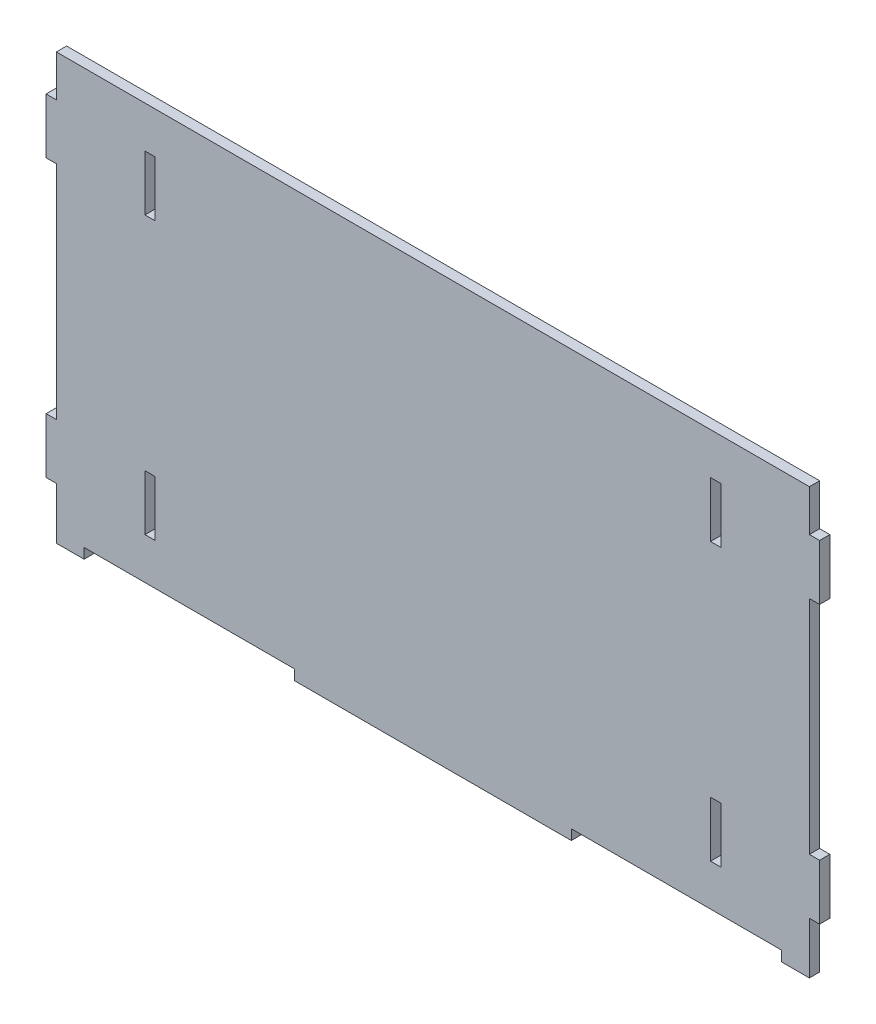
ISO-10303-21;
HEADER;
FILE_DESCRIPTION(('STEP AP214'),'2;1');
FILE_NAME('part.step','',(''),(''),'','','');
FILE_SCHEMA(('AUTOMOTIVE_DESIGN { 1 0 10303 214 1 1 1 1 }'));
ENDSEC;
DATA;
#1=APPLICATION_CONTEXT('core data for automotive mechanical design processes');
#2=APPLICATION_PROTOCOL_DEFINITION('international standard','automotive_design',2000,#1);
#3=PRODUCT_CONTEXT('',#1,'mechanical');
#4=PRODUCT('Part','Part','',(#3));
#5=PRODUCT_RELATED_PRODUCT_CATEGORY('part','',(#4));
#6=PRODUCT_DEFINITION_FORMATION('','',#4);
#7=PRODUCT_DEFINITION_CONTEXT('part definition',#1,'design');
#8=PRODUCT_DEFINITION('design','',#6,#7);
#9=PRODUCT_DEFINITION_SHAPE('','',#8);
#10=(LENGTH_UNIT() NAMED_UNIT(*) SI_UNIT(.MILLI.,.METRE.));
#11=(NAMED_UNIT(*) PLANE_ANGLE_UNIT() SI_UNIT($,.RADIAN.));
#12=(NAMED_UNIT(*) SI_UNIT($,.STERADIAN.) SOLID_ANGLE_UNIT());
#13=UNCERTAINTY_MEASURE_WITH_UNIT(LENGTH_MEASURE(1.E-05),#10,'distance_accuracy_value','');
#14=(GEOMETRIC_REPRESENTATION_CONTEXT(3) GLOBAL_UNCERTAINTY_ASSIGNED_CONTEXT((#13)) GLOBAL_UNIT_ASSIGNED_CONTEXT((#10,
#11,#12)) REPRESENTATION_CONTEXT('',''));
#15=CARTESIAN_POINT('',(0.,0.,0.));
#16=DIRECTION('',(0.,0.,1.));
#17=DIRECTION('',(1.,0.,0.));
#18=AXIS2_PLACEMENT_3D('',#15,#16,#17);
#19=CARTESIAN_POINT('',(-136.,138.7,3.7));
#20=DIRECTION('',(0.,0.,-1.));
#21=DIRECTION('',(-1.,0.,0.));
#22=AXIS2_PLACEMENT_3D('',#19,#20,#21);
#23=PLANE('',#22);
#24=DIRECTION('',(0.,-1.,0.));
#25=VECTOR('',#24,1.);
#26=CARTESIAN_POINT('',(100.3,138.7,3.7));
#27=LINE('',#26,#25);
#28=CARTESIAN_POINT('',(100.3,138.7,3.7));
#29=VERTEX_POINT('',#28);
#30=CARTESIAN_POINT('',(100.3,118.7,3.7));
#31=VERTEX_POINT('',#30);
#32=EDGE_CURVE('E350',#29,#31,#27,.T.);
#33=ORIENTED_EDGE('',*,*,#32,.F.);
#34=DIRECTION('',(-1.,0.,0.));
#35=VECTOR('',#34,1.);
#36=CARTESIAN_POINT('',(100.3,138.7,3.7));
#37=LINE('',#36,#35);
#38=CARTESIAN_POINT('',(104.,138.7,3.7));
#39=VERTEX_POINT('',#38);
#40=EDGE_CURVE('E358',#39,#29,#37,.T.);
#41=ORIENTED_EDGE('',*,*,#40,.F.);
#42=DIRECTION('',(0.,1.,0.));
#43=VECTOR('',#42,1.);
#44=CARTESIAN_POINT('',(104.,138.7,3.7));
#45=LINE('',#44,#43);
#46=CARTESIAN_POINT('',(104.,118.7,3.7));
#47=VERTEX_POINT('',#46);
#48=EDGE_CURVE('E355',#47,#39,#45,.T.);
#49=ORIENTED_EDGE('',*,*,#48,.F.);
#50=DIRECTION('',(1.,0.,0.));
#51=VECTOR('',#50,1.);
#52=CARTESIAN_POINT('',(100.3,118.7,3.7));
#53=LINE('',#52,#51);
#54=EDGE_CURVE('E352',#31,#47,#53,.T.);
#55=ORIENTED_EDGE('',*,*,#54,.F.);
#56=EDGE_LOOP('',(#33,#41,#49,#55));
#57=FACE_BOUND('',#56,.T.);
#58=DIRECTION('',(0.,-1.,0.));
#59=VECTOR('',#58,1.);
#60=CARTESIAN_POINT('',(-104.,138.7,3.7));
#61=LINE('',#60,#59);
#62=CARTESIAN_POINT('',(-104.,138.7,3.7));
#63=VERTEX_POINT('',#62);
#64=CARTESIAN_POINT('',(-104.,118.7,3.7));
#65=VERTEX_POINT('',#64);
#66=EDGE_CURVE('E412',#63,#65,#61,.T.);
#67=ORIENTED_EDGE('',*,*,#66,.F.);
#68=DIRECTION('',(-1.,0.,0.));
#69=VECTOR('',#68,1.);
#70=CARTESIAN_POINT('',(-104.,138.7,3.7));
#71=LINE('',#70,#69);
#72=CARTESIAN_POINT('',(-100.3,138.7,3.7));
#73=VERTEX_POINT('',#72);
#74=EDGE_CURVE('E420',#73,#63,#71,.T.);
#75=ORIENTED_EDGE('',*,*,#74,.F.);
#76=DIRECTION('',(0.,1.,0.));
#77=VECTOR('',#76,1.);
#78=CARTESIAN_POINT('',(-100.3,138.7,3.7));
#79=LINE('',#78,#77);
#80=CARTESIAN_POINT('',(-100.3,118.7,3.7));
#81=VERTEX_POINT('',#80);
#82=EDGE_CURVE('E417',#81,#73,#79,.T.);
#83=ORIENTED_EDGE('',*,*,#82,.F.);
#84=DIRECTION('',(1.,0.,0.));
#85=VECTOR('',#84,1.);
#86=CARTESIAN_POINT('',(-104.,118.7,3.7));
#87=LINE('',#86,#85);
#88=EDGE_CURVE('E414',#65,#81,#87,.T.);
#89=ORIENTED_EDGE('',*,*,#88,.F.);
#90=EDGE_LOOP('',(#67,#75,#83,#89));
#91=FACE_BOUND('',#90,.T.);
#92=DIRECTION('',(0.,-1.,0.));
#93=VECTOR('',#92,1.);
#94=CARTESIAN_POINT('',(-136.,153.7,3.7));
#95=LINE('',#94,#93);
#96=CARTESIAN_POINT('',(-136.,153.7,3.7));
#97=VERTEX_POINT('',#96);
#98=CARTESIAN_POINT('',(-136.,138.7,3.7));
#99=VERTEX_POINT('',#98);
#100=EDGE_CURVE('E443',#97,#99,#95,.T.);
#101=ORIENTED_EDGE('',*,*,#100,.T.);
#102=DIRECTION('',(-1.,0.,0.));
#103=VECTOR('',#102,1.);
#104=CARTESIAN_POINT('',(-136.,138.7,3.7));
#105=LINE('',#104,#103);
#106=CARTESIAN_POINT('',(-139.7,138.7,3.7));
#107=VERTEX_POINT('',#106);
#108=EDGE_CURVE('E446',#99,#107,#105,.T.);
#109=ORIENTED_EDGE('',*,*,#108,.T.);
#110=DIRECTION('',(0.,-1.,0.));
#111=VECTOR('',#110,1.);
#112=CARTESIAN_POINT('',(-139.7,138.7,3.7));
#113=LINE('',#112,#111);
#114=CARTESIAN_POINT('',(-139.7,118.7,3.7));
#115=VERTEX_POINT('',#114);
#116=EDGE_CURVE('E449',#107,#115,#113,.T.);
#117=ORIENTED_EDGE('',*,*,#116,.T.);
#118=DIRECTION('',(1.,0.,0.));
#119=VECTOR('',#118,1.);
#120=CARTESIAN_POINT('',(-136.,118.7,3.7));
#121=LINE('',#120,#119);
#122=CARTESIAN_POINT('',(-136.,118.7,3.7));
#123=VERTEX_POINT('',#122);
#124=EDGE_CURVE('E451',#115,#123,#121,.T.);
#125=ORIENTED_EDGE('',*,*,#124,.T.);
#126=DIRECTION('',(0.,-1.,0.));
#127=VECTOR('',#126,1.);
#128=CARTESIAN_POINT('',(-136.,118.7,3.7));
#129=LINE('',#128,#127);
#130=CARTESIAN_POINT('',(-136.,38.7,3.7));
#131=VERTEX_POINT('',#130);
#132=EDGE_CURVE('E453',#123,#131,#129,.T.);
#133=ORIENTED_EDGE('',*,*,#132,.T.);
#134=DIRECTION('',(-1.,0.,0.));
#135=VECTOR('',#134,1.);
#136=CARTESIAN_POINT('',(-136.,38.7,3.7));
#137=LINE('',#136,#135);
#138=CARTESIAN_POINT('',(-139.7,38.7,3.7));
#139=VERTEX_POINT('',#138);
#140=EDGE_CURVE('E455',#131,#139,#137,.T.);
#141=ORIENTED_EDGE('',*,*,#140,.T.);
#142=DIRECTION('',(0.,-1.,0.));
#143=VECTOR('',#142,1.);
#144=CARTESIAN_POINT('',(-139.7,38.7,3.7));
#145=LINE('',#144,#143);
#146=CARTESIAN_POINT('',(-139.7,18.7,3.7));
#147=VERTEX_POINT('',#146);
#148=EDGE_CURVE('E457',#139,#147,#145,.T.);
#149=ORIENTED_EDGE('',*,*,#148,.T.);
#150=DIRECTION('',(1.,0.,0.));
#151=VECTOR('',#150,1.);
#152=CARTESIAN_POINT('',(-136.,18.7,3.7));
#153=LINE('',#152,#151);
#154=CARTESIAN_POINT('',(-136.,18.7,3.7));
#155=VERTEX_POINT('',#154);
#156=EDGE_CURVE('E459',#147,#155,#153,.T.);
#157=ORIENTED_EDGE('',*,*,#156,.T.);
#158=DIRECTION('',(0.,-1.,0.));
#159=VECTOR('',#158,1.);
#160=CARTESIAN_POINT('',(-136.,18.7,3.7));
#161=LINE('',#160,#159);
#162=CARTESIAN_POINT('',(-136.,0.,3.7));
#163=VERTEX_POINT('',#162);
#164=EDGE_CURVE('E461',#155,#163,#161,.T.);
#165=ORIENTED_EDGE('',*,*,#164,.T.);
#166=DIRECTION('',(1.,0.,0.));
#167=VECTOR('',#166,1.);
#168=CARTESIAN_POINT('',(-136.,0.,3.7));
#169=LINE('',#168,#167);
#170=CARTESIAN_POINT('',(-126.,0.,3.7));
#171=VERTEX_POINT('',#170);
#172=EDGE_CURVE('E463',#163,#171,#169,.T.);
#173=ORIENTED_EDGE('',*,*,#172,.T.);
#174=DIRECTION('',(0.,1.,0.));
#175=VECTOR('',#174,1.);
#176=CARTESIAN_POINT('',(-126.,0.,3.7));
#177=LINE('',#176,#175);
#178=CARTESIAN_POINT('',(-126.,3.7,3.7));
#179=VERTEX_POINT('',#178);
#180=EDGE_CURVE('E465',#171,#179,#177,.T.);
#181=ORIENTED_EDGE('',*,*,#180,.T.);
#182=DIRECTION('',(1.,0.,0.));
#183=VECTOR('',#182,1.);
#184=CARTESIAN_POINT('',(-126.,3.7,3.7));
#185=LINE('',#184,#183);
#186=CARTESIAN_POINT('',(-50.,3.7,3.7));
#187=VERTEX_POINT('',#186);
#188=EDGE_CURVE('E467',#179,#187,#185,.T.);
#189=ORIENTED_EDGE('',*,*,#188,.T.);
#190=DIRECTION('',(0.,-1.,0.));
#191=VECTOR('',#190,1.);
#192=CARTESIAN_POINT('',(-50.,0.,3.7));
#193=LINE('',#192,#191);
#194=CARTESIAN_POINT('',(-50.,0.,3.7));
#195=VERTEX_POINT('',#194);
#196=EDGE_CURVE('E469',#187,#195,#193,.T.);
#197=ORIENTED_EDGE('',*,*,#196,.T.);
#198=DIRECTION('',(1.,0.,0.));
#199=VECTOR('',#198,1.);
#200=CARTESIAN_POINT('',(-50.,0.,3.7));
#201=LINE('',#200,#199);
#202=CARTESIAN_POINT('',(50.,0.,3.7));
#203=VERTEX_POINT('',#202);
#204=EDGE_CURVE('E471',#195,#203,#201,.T.);
#205=ORIENTED_EDGE('',*,*,#204,.T.);
#206=DIRECTION('',(0.,1.,0.));
#207=VECTOR('',#206,1.);
#208=CARTESIAN_POINT('',(50.,0.,3.7));
#209=LINE('',#208,#207);
#210=CARTESIAN_POINT('',(50.,3.7,3.7));
#211=VERTEX_POINT('',#210);
#212=EDGE_CURVE('E473',#203,#211,#209,.T.);
#213=ORIENTED_EDGE('',*,*,#212,.T.);
#214=DIRECTION('',(1.,0.,0.));
#215=VECTOR('',#214,1.);
#216=CARTESIAN_POINT('',(50.,3.7,3.7));
#217=LINE('',#216,#215);
#218=CARTESIAN_POINT('',(126.,3.7,3.7));
#219=VERTEX_POINT('',#218);
#220=EDGE_CURVE('E475',#211,#219,#217,.T.);
#221=ORIENTED_EDGE('',*,*,#220,.T.);
#222=DIRECTION('',(0.,-1.,0.));
#223=VECTOR('',#222,1.);
#224=CARTESIAN_POINT('',(126.,0.,3.7));
#225=LINE('',#224,#223);
#226=CARTESIAN_POINT('',(126.,0.,3.7));
#227=VERTEX_POINT('',#226);
#228=EDGE_CURVE('E477',#219,#227,#225,.T.);
#229=ORIENTED_EDGE('',*,*,#228,.T.);
#230=DIRECTION('',(1.,0.,0.));
#231=VECTOR('',#230,1.);
#232=CARTESIAN_POINT('',(126.,0.,3.7));
#233=LINE('',#232,#231);
#234=CARTESIAN_POINT('',(136.,0.,3.7));
#235=VERTEX_POINT('',#234);
#236=EDGE_CURVE('E479',#227,#235,#233,.T.);
#237=ORIENTED_EDGE('',*,*,#236,.T.);
#238=DIRECTION('',(0.,1.,0.));
#239=VECTOR('',#238,1.);
#240=CARTESIAN_POINT('',(136.,18.7,3.7));
#241=LINE('',#240,#239);
#242=CARTESIAN_POINT('',(136.,18.7,3.7));
#243=VERTEX_POINT('',#242);
#244=EDGE_CURVE('E481',#235,#243,#241,.T.);
#245=ORIENTED_EDGE('',*,*,#244,.T.);
#246=DIRECTION('',(1.,0.,0.));
#247=VECTOR('',#246,1.);
#248=CARTESIAN_POINT('',(136.,18.7,3.7));
#249=LINE('',#248,#247);
#250=CARTESIAN_POINT('',(139.7,18.7,3.7));
#251=VERTEX_POINT('',#250);
#252=EDGE_CURVE('E483',#243,#251,#249,.T.);
#253=ORIENTED_EDGE('',*,*,#252,.T.);
#254=DIRECTION('',(0.,1.,0.));
#255=VECTOR('',#254,1.);
#256=CARTESIAN_POINT('',(139.7,38.7,3.7));
#257=LINE('',#256,#255);
#258=CARTESIAN_POINT('',(139.7,38.7,3.7));
#259=VERTEX_POINT('',#258);
#260=EDGE_CURVE('E485',#251,#259,#257,.T.);
#261=ORIENTED_EDGE('',*,*,#260,.T.);
#262=DIRECTION('',(-1.,0.,0.));
#263=VECTOR('',#262,1.);
#264=CARTESIAN_POINT('',(136.,38.7,3.7));
#265=LINE('',#264,#263);
#266=CARTESIAN_POINT('',(136.,38.7,3.7));
#267=VERTEX_POINT('',#266);
#268=EDGE_CURVE('E487',#259,#267,#265,.T.);
#269=ORIENTED_EDGE('',*,*,#268,.T.);
#270=DIRECTION('',(0.,1.,0.));
#271=VECTOR('',#270,1.);
#272=CARTESIAN_POINT('',(136.,118.7,3.7));
#273=LINE('',#272,#271);
#274=CARTESIAN_POINT('',(136.,118.7,3.7));
#275=VERTEX_POINT('',#274);
#276=EDGE_CURVE('E489',#267,#275,#273,.T.);
#277=ORIENTED_EDGE('',*,*,#276,.T.);
#278=DIRECTION('',(1.,0.,0.));
#279=VECTOR('',#278,1.);
#280=CARTESIAN_POINT('',(136.,118.7,3.7));
#281=LINE('',#280,#279);
#282=CARTESIAN_POINT('',(139.7,118.7,3.7));
#283=VERTEX_POINT('',#282);
#284=EDGE_CURVE('E491',#275,#283,#281,.T.);
#285=ORIENTED_EDGE('',*,*,#284,.T.);
#286=DIRECTION('',(0.,1.,0.));
#287=VECTOR('',#286,1.);
#288=CARTESIAN_POINT('',(139.7,138.7,3.7));
#289=LINE('',#288,#287);
#290=CARTESIAN_POINT('',(139.7,138.7,3.7));
#291=VERTEX_POINT('',#290);
#292=EDGE_CURVE('E493',#283,#291,#289,.T.);
#293=ORIENTED_EDGE('',*,*,#292,.T.);
#294=DIRECTION('',(-1.,0.,0.));
#295=VECTOR('',#294,1.);
#296=CARTESIAN_POINT('',(136.,138.7,3.7));
#297=LINE('',#296,#295);
#298=CARTESIAN_POINT('',(136.,138.7,3.7));
#299=VERTEX_POINT('',#298);
#300=EDGE_CURVE('E495',#291,#299,#297,.T.);
#301=ORIENTED_EDGE('',*,*,#300,.T.);
#302=DIRECTION('',(0.,1.,0.));
#303=VECTOR('',#302,1.);
#304=CARTESIAN_POINT('',(136.,153.7,3.7));
#305=LINE('',#304,#303);
#306=CARTESIAN_POINT('',(136.,153.7,3.7));
#307=VERTEX_POINT('',#306);
#308=EDGE_CURVE('E497',#299,#307,#305,.T.);
#309=ORIENTED_EDGE('',*,*,#308,.T.);
#310=DIRECTION('',(-1.,0.,0.));
#311=VECTOR('',#310,1.);
#312=CARTESIAN_POINT('',(-136.,153.7,3.7));
#313=LINE('',#312,#311);
#314=EDGE_CURVE('E499',#307,#97,#313,.T.);
#315=ORIENTED_EDGE('',*,*,#314,.T.);
#316=EDGE_LOOP('',(#101,#109,#117,#125,#133,#141,#149,#157,#165,#173,#181,#189,#197,#205,#213,
#221,#229,#237,#245,#253,#261,#269,#277,#285,#293,#301,#309,#315));
#317=FACE_BOUND('',#316,.T.);
#318=DIRECTION('',(1.,0.,0.));
#319=VECTOR('',#318,1.);
#320=CARTESIAN_POINT('',(-104.,18.7,3.7));
#321=LINE('',#320,#319);
#322=CARTESIAN_POINT('',(-104.,18.7,3.7));
#323=VERTEX_POINT('',#322);
#324=CARTESIAN_POINT('',(-100.3,18.7,3.7));
#325=VERTEX_POINT('',#324);
#326=EDGE_CURVE('E381',#323,#325,#321,.T.);
#327=ORIENTED_EDGE('',*,*,#326,.F.);
#328=DIRECTION('',(0.,-1.,0.));
#329=VECTOR('',#328,1.);
#330=CARTESIAN_POINT('',(-104.,38.7,3.7));
#331=LINE('',#330,#329);
#332=CARTESIAN_POINT('',(-104.,38.7,3.7));
#333=VERTEX_POINT('',#332);
#334=EDGE_CURVE('E389',#333,#323,#331,.T.);
#335=ORIENTED_EDGE('',*,*,#334,.F.);
#336=DIRECTION('',(-1.,0.,0.));
#337=VECTOR('',#336,1.);
#338=CARTESIAN_POINT('',(-104.,38.7,3.7));
#339=LINE('',#338,#337);
#340=CARTESIAN_POINT('',(-100.3,38.7,3.7));
#341=VERTEX_POINT('',#340);
#342=EDGE_CURVE('E386',#341,#333,#339,.T.);
#343=ORIENTED_EDGE('',*,*,#342,.F.);
#344=DIRECTION('',(0.,1.,0.));
#345=VECTOR('',#344,1.);
#346=CARTESIAN_POINT('',(-100.3,38.7,3.7));
#347=LINE('',#346,#345);
#348=EDGE_CURVE('E383',#325,#341,#347,.T.);
#349=ORIENTED_EDGE('',*,*,#348,.F.);
#350=EDGE_LOOP('',(#327,#335,#343,#349));
#351=FACE_BOUND('',#350,.T.);
#352=DIRECTION('',(0.,1.,0.));
#353=VECTOR('',#352,1.);
#354=CARTESIAN_POINT('',(104.,38.7,3.7));
#355=LINE('',#354,#353);
#356=CARTESIAN_POINT('',(104.,18.7,3.7));
#357=VERTEX_POINT('',#356);
#358=CARTESIAN_POINT('',(104.,38.7,3.7));
#359=VERTEX_POINT('',#358);
#360=EDGE_CURVE('E314',#357,#359,#355,.T.);
#361=ORIENTED_EDGE('',*,*,#360,.F.);
#362=DIRECTION('',(1.,0.,0.));
#363=VECTOR('',#362,1.);
#364=CARTESIAN_POINT('',(100.3,18.7,3.7));
#365=LINE('',#364,#363);
#366=CARTESIAN_POINT('',(100.3,18.7,3.7));
#367=VERTEX_POINT('',#366);
#368=EDGE_CURVE('E336',#367,#357,#365,.T.);
#369=ORIENTED_EDGE('',*,*,#368,.F.);
#370=DIRECTION('',(0.,-1.,0.));
#371=VECTOR('',#370,1.);
#372=CARTESIAN_POINT('',(100.3,38.7,3.7));
#373=LINE('',#372,#371);
#374=CARTESIAN_POINT('',(100.3,38.7,3.7));
#375=VERTEX_POINT('',#374);
#376=EDGE_CURVE('E334',#375,#367,#373,.T.);
#377=ORIENTED_EDGE('',*,*,#376,.F.);
#378=DIRECTION('',(-1.,0.,0.));
#379=VECTOR('',#378,1.);
#380=CARTESIAN_POINT('',(100.3,38.7,3.7));
#381=LINE('',#380,#379);
#382=EDGE_CURVE('E322',#359,#375,#381,.T.);
#383=ORIENTED_EDGE('',*,*,#382,.F.);
#384=EDGE_LOOP('',(#361,#369,#377,#383));
#385=FACE_BOUND('',#384,.T.);
#386=ADVANCED_FACE('F33',(#57,#91,#317,#351,#385),#23,.F.);
#387=CARTESIAN_POINT('',(-136.,138.7,0.));
#388=DIRECTION('',(0.,0.,-1.));
#389=DIRECTION('',(-1.,0.,0.));
#390=AXIS2_PLACEMENT_3D('',#387,#388,#389);
#391=PLANE('',#390);
#392=DIRECTION('',(-1.,0.,0.));
#393=VECTOR('',#392,1.);
#394=CARTESIAN_POINT('',(100.3,138.7,0.));
#395=LINE('',#394,#393);
#396=CARTESIAN_POINT('',(104.,138.7,0.));
#397=VERTEX_POINT('',#396);
#398=CARTESIAN_POINT('',(100.3,138.7,0.));
#399=VERTEX_POINT('',#398);
#400=EDGE_CURVE('E353',#397,#399,#395,.T.);
#401=ORIENTED_EDGE('',*,*,#400,.T.);
#402=DIRECTION('',(0.,-1.,0.));
#403=VECTOR('',#402,1.);
#404=CARTESIAN_POINT('',(100.3,138.7,0.));
#405=LINE('',#404,#403);
#406=CARTESIAN_POINT('',(100.3,118.7,0.));
#407=VERTEX_POINT('',#406);
#408=EDGE_CURVE('E330',#399,#407,#405,.T.);
#409=ORIENTED_EDGE('',*,*,#408,.T.);
#410=DIRECTION('',(1.,0.,0.));
#411=VECTOR('',#410,1.);
#412=CARTESIAN_POINT('',(100.3,118.7,0.));
#413=LINE('',#412,#411);
#414=CARTESIAN_POINT('',(104.,118.7,0.));
#415=VERTEX_POINT('',#414);
#416=EDGE_CURVE('E363',#407,#415,#413,.T.);
#417=ORIENTED_EDGE('',*,*,#416,.T.);
#418=DIRECTION('',(0.,1.,0.));
#419=VECTOR('',#418,1.);
#420=CARTESIAN_POINT('',(104.,138.7,0.));
#421=LINE('',#420,#419);
#422=EDGE_CURVE('E366',#415,#397,#421,.T.);
#423=ORIENTED_EDGE('',*,*,#422,.T.);
#424=EDGE_LOOP('',(#401,#409,#417,#423));
#425=FACE_BOUND('',#424,.T.);
#426=DIRECTION('',(-1.,0.,0.));
#427=VECTOR('',#426,1.);
#428=CARTESIAN_POINT('',(-104.,138.7,0.));
#429=LINE('',#428,#427);
#430=CARTESIAN_POINT('',(-100.3,138.7,0.));
#431=VERTEX_POINT('',#430);
#432=CARTESIAN_POINT('',(-104.,138.7,0.));
#433=VERTEX_POINT('',#432);
#434=EDGE_CURVE('E415',#431,#433,#429,.T.);
#435=ORIENTED_EDGE('',*,*,#434,.T.);
#436=DIRECTION('',(0.,-1.,0.));
#437=VECTOR('',#436,1.);
#438=CARTESIAN_POINT('',(-104.,138.7,0.));
#439=LINE('',#438,#437);
#440=CARTESIAN_POINT('',(-104.,118.7,0.));
#441=VERTEX_POINT('',#440);
#442=EDGE_CURVE('E411',#433,#441,#439,.T.);
#443=ORIENTED_EDGE('',*,*,#442,.T.);
#444=DIRECTION('',(1.,0.,0.));
#445=VECTOR('',#444,1.);
#446=CARTESIAN_POINT('',(-104.,118.7,0.));
#447=LINE('',#446,#445);
#448=CARTESIAN_POINT('',(-100.3,118.7,0.));
#449=VERTEX_POINT('',#448);
#450=EDGE_CURVE('E425',#441,#449,#447,.T.);
#451=ORIENTED_EDGE('',*,*,#450,.T.);
#452=DIRECTION('',(0.,1.,0.));
#453=VECTOR('',#452,1.);
#454=CARTESIAN_POINT('',(-100.3,138.7,0.));
#455=LINE('',#454,#453);
#456=EDGE_CURVE('E428',#449,#431,#455,.T.);
#457=ORIENTED_EDGE('',*,*,#456,.T.);
#458=EDGE_LOOP('',(#435,#443,#451,#457));
#459=FACE_BOUND('',#458,.T.);
#460=DIRECTION('',(0.,-1.,0.));
#461=VECTOR('',#460,1.);
#462=CARTESIAN_POINT('',(-136.,153.7,0.));
#463=LINE('',#462,#461);
#464=CARTESIAN_POINT('',(-136.,153.7,0.));
#465=VERTEX_POINT('',#464);
#466=CARTESIAN_POINT('',(-136.,138.7,0.));
#467=VERTEX_POINT('',#466);
#468=EDGE_CURVE('E442',#465,#467,#463,.T.);
#469=ORIENTED_EDGE('',*,*,#468,.F.);
#470=DIRECTION('',(-1.,0.,0.));
#471=VECTOR('',#470,1.);
#472=CARTESIAN_POINT('',(-136.,153.7,0.));
#473=LINE('',#472,#471);
#474=CARTESIAN_POINT('',(136.,153.7,0.));
#475=VERTEX_POINT('',#474);
#476=EDGE_CURVE('E447',#475,#465,#473,.T.);
#477=ORIENTED_EDGE('',*,*,#476,.F.);
#478=DIRECTION('',(0.,1.,0.));
#479=VECTOR('',#478,1.);
#480=CARTESIAN_POINT('',(136.,153.7,0.));
#481=LINE('',#480,#479);
#482=CARTESIAN_POINT('',(136.,138.7,0.));
#483=VERTEX_POINT('',#482);
#484=EDGE_CURVE('E554',#483,#475,#481,.T.);
#485=ORIENTED_EDGE('',*,*,#484,.F.);
#486=DIRECTION('',(-1.,0.,0.));
#487=VECTOR('',#486,1.);
#488=CARTESIAN_POINT('',(136.,138.7,0.));
#489=LINE('',#488,#487);
#490=CARTESIAN_POINT('',(139.7,138.7,0.));
#491=VERTEX_POINT('',#490);
#492=EDGE_CURVE('E552',#491,#483,#489,.T.);
#493=ORIENTED_EDGE('',*,*,#492,.F.);
#494=DIRECTION('',(0.,1.,0.));
#495=VECTOR('',#494,1.);
#496=CARTESIAN_POINT('',(139.7,138.7,0.));
#497=LINE('',#496,#495);
#498=CARTESIAN_POINT('',(139.7,118.7,0.));
#499=VERTEX_POINT('',#498);
#500=EDGE_CURVE('E550',#499,#491,#497,.T.);
#501=ORIENTED_EDGE('',*,*,#500,.F.);
#502=DIRECTION('',(1.,0.,0.));
#503=VECTOR('',#502,1.);
#504=CARTESIAN_POINT('',(136.,118.7,0.));
#505=LINE('',#504,#503);
#506=CARTESIAN_POINT('',(136.,118.7,0.));
#507=VERTEX_POINT('',#506);
#508=EDGE_CURVE('E548',#507,#499,#505,.T.);
#509=ORIENTED_EDGE('',*,*,#508,.F.);
#510=DIRECTION('',(0.,1.,0.));
#511=VECTOR('',#510,1.);
#512=CARTESIAN_POINT('',(136.,118.7,0.));
#513=LINE('',#512,#511);
#514=CARTESIAN_POINT('',(136.,38.7,0.));
#515=VERTEX_POINT('',#514);
#516=EDGE_CURVE('E546',#515,#507,#513,.T.);
#517=ORIENTED_EDGE('',*,*,#516,.F.);
#518=DIRECTION('',(-1.,0.,0.));
#519=VECTOR('',#518,1.);
#520=CARTESIAN_POINT('',(136.,38.7,0.));
#521=LINE('',#520,#519);
#522=CARTESIAN_POINT('',(139.7,38.7,0.));
#523=VERTEX_POINT('',#522);
#524=EDGE_CURVE('E544',#523,#515,#521,.T.);
#525=ORIENTED_EDGE('',*,*,#524,.F.);
#526=DIRECTION('',(0.,1.,0.));
#527=VECTOR('',#526,1.);
#528=CARTESIAN_POINT('',(139.7,38.7,0.));
#529=LINE('',#528,#527);
#530=CARTESIAN_POINT('',(139.7,18.7,0.));
#531=VERTEX_POINT('',#530);
#532=EDGE_CURVE('E542',#531,#523,#529,.T.);
#533=ORIENTED_EDGE('',*,*,#532,.F.);
#534=DIRECTION('',(1.,0.,0.));
#535=VECTOR('',#534,1.);
#536=CARTESIAN_POINT('',(136.,18.7,0.));
#537=LINE('',#536,#535);
#538=CARTESIAN_POINT('',(136.,18.7,0.));
#539=VERTEX_POINT('',#538);
#540=EDGE_CURVE('E540',#539,#531,#537,.T.);
#541=ORIENTED_EDGE('',*,*,#540,.F.);
#542=DIRECTION('',(0.,1.,0.));
#543=VECTOR('',#542,1.);
#544=CARTESIAN_POINT('',(136.,18.7,0.));
#545=LINE('',#544,#543);
#546=CARTESIAN_POINT('',(136.,0.,0.));
#547=VERTEX_POINT('',#546);
#548=EDGE_CURVE('E538',#547,#539,#545,.T.);
#549=ORIENTED_EDGE('',*,*,#548,.F.);
#550=DIRECTION('',(1.,0.,0.));
#551=VECTOR('',#550,1.);
#552=CARTESIAN_POINT('',(126.,0.,0.));
#553=LINE('',#552,#551);
#554=CARTESIAN_POINT('',(126.,0.,0.));
#555=VERTEX_POINT('',#554);
#556=EDGE_CURVE('E536',#555,#547,#553,.T.);
#557=ORIENTED_EDGE('',*,*,#556,.F.);
#558=DIRECTION('',(0.,-1.,0.));
#559=VECTOR('',#558,1.);
#560=CARTESIAN_POINT('',(126.,0.,0.));
#561=LINE('',#560,#559);
#562=CARTESIAN_POINT('',(126.,3.7,0.));
#563=VERTEX_POINT('',#562);
#564=EDGE_CURVE('E534',#563,#555,#561,.T.);
#565=ORIENTED_EDGE('',*,*,#564,.F.);
#566=DIRECTION('',(1.,0.,0.));
#567=VECTOR('',#566,1.);
#568=CARTESIAN_POINT('',(50.,3.7,0.));
#569=LINE('',#568,#567);
#570=CARTESIAN_POINT('',(50.,3.7,0.));
#571=VERTEX_POINT('',#570);
#572=EDGE_CURVE('E532',#571,#563,#569,.T.);
#573=ORIENTED_EDGE('',*,*,#572,.F.);
#574=DIRECTION('',(0.,1.,0.));
#575=VECTOR('',#574,1.);
#576=CARTESIAN_POINT('',(50.,0.,0.));
#577=LINE('',#576,#575);
#578=CARTESIAN_POINT('',(50.,0.,0.));
#579=VERTEX_POINT('',#578);
#580=EDGE_CURVE('E530',#579,#571,#577,.T.);
#581=ORIENTED_EDGE('',*,*,#580,.F.);
#582=DIRECTION('',(1.,0.,0.));
#583=VECTOR('',#582,1.);
#584=CARTESIAN_POINT('',(-50.,0.,0.));
#585=LINE('',#584,#583);
#586=CARTESIAN_POINT('',(-50.,0.,0.));
#587=VERTEX_POINT('',#586);
#588=EDGE_CURVE('E528',#587,#579,#585,.T.);
#589=ORIENTED_EDGE('',*,*,#588,.F.);
#590=DIRECTION('',(0.,-1.,0.));
#591=VECTOR('',#590,1.);
#592=CARTESIAN_POINT('',(-50.,0.,0.));
#593=LINE('',#592,#591);
#594=CARTESIAN_POINT('',(-50.,3.7,0.));
#595=VERTEX_POINT('',#594);
#596=EDGE_CURVE('E526',#595,#587,#593,.T.);
#597=ORIENTED_EDGE('',*,*,#596,.F.);
#598=DIRECTION('',(1.,0.,0.));
#599=VECTOR('',#598,1.);
#600=CARTESIAN_POINT('',(-126.,3.7,0.));
#601=LINE('',#600,#599);
#602=CARTESIAN_POINT('',(-126.,3.7,0.));
#603=VERTEX_POINT('',#602);
#604=EDGE_CURVE('E524',#603,#595,#601,.T.);
#605=ORIENTED_EDGE('',*,*,#604,.F.);
#606=DIRECTION('',(0.,1.,0.));
#607=VECTOR('',#606,1.);
#608=CARTESIAN_POINT('',(-126.,0.,0.));
#609=LINE('',#608,#607);
#610=CARTESIAN_POINT('',(-126.,0.,0.));
#611=VERTEX_POINT('',#610);
#612=EDGE_CURVE('E522',#611,#603,#609,.T.);
#613=ORIENTED_EDGE('',*,*,#612,.F.);
#614=DIRECTION('',(1.,0.,0.));
#615=VECTOR('',#614,1.);
#616=CARTESIAN_POINT('',(-136.,0.,0.));
#617=LINE('',#616,#615);
#618=CARTESIAN_POINT('',(-136.,0.,0.));
#619=VERTEX_POINT('',#618);
#620=EDGE_CURVE('E520',#619,#611,#617,.T.);
#621=ORIENTED_EDGE('',*,*,#620,.F.);
#622=DIRECTION('',(0.,-1.,0.));
#623=VECTOR('',#622,1.);
#624=CARTESIAN_POINT('',(-136.,18.7,0.));
#625=LINE('',#624,#623);
#626=CARTESIAN_POINT('',(-136.,18.7,0.));
#627=VERTEX_POINT('',#626);
#628=EDGE_CURVE('E518',#627,#619,#625,.T.);
#629=ORIENTED_EDGE('',*,*,#628,.F.);
#630=DIRECTION('',(1.,0.,0.));
#631=VECTOR('',#630,1.);
#632=CARTESIAN_POINT('',(-136.,18.7,0.));
#633=LINE('',#632,#631);
#634=CARTESIAN_POINT('',(-139.7,18.7,0.));
#635=VERTEX_POINT('',#634);
#636=EDGE_CURVE('E516',#635,#627,#633,.T.);
#637=ORIENTED_EDGE('',*,*,#636,.F.);
#638=DIRECTION('',(0.,-1.,0.));
#639=VECTOR('',#638,1.);
#640=CARTESIAN_POINT('',(-139.7,38.7,0.));
#641=LINE('',#640,#639);
#642=CARTESIAN_POINT('',(-139.7,38.7,0.));
#643=VERTEX_POINT('',#642);
#644=EDGE_CURVE('E514',#643,#635,#641,.T.);
#645=ORIENTED_EDGE('',*,*,#644,.F.);
#646=DIRECTION('',(-1.,0.,0.));
#647=VECTOR('',#646,1.);
#648=CARTESIAN_POINT('',(-136.,38.7,0.));
#649=LINE('',#648,#647);
#650=CARTESIAN_POINT('',(-136.,38.7,0.));
#651=VERTEX_POINT('',#650);
#652=EDGE_CURVE('E512',#651,#643,#649,.T.);
#653=ORIENTED_EDGE('',*,*,#652,.F.);
#654=DIRECTION('',(0.,-1.,0.));
#655=VECTOR('',#654,1.);
#656=CARTESIAN_POINT('',(-136.,118.7,0.));
#657=LINE('',#656,#655);
#658=CARTESIAN_POINT('',(-136.,118.7,0.));
#659=VERTEX_POINT('',#658);
#660=EDGE_CURVE('E510',#659,#651,#657,.T.);
#661=ORIENTED_EDGE('',*,*,#660,.F.);
#662=DIRECTION('',(1.,0.,0.));
#663=VECTOR('',#662,1.);
#664=CARTESIAN_POINT('',(-136.,118.7,0.));
#665=LINE('',#664,#663);
#666=CARTESIAN_POINT('',(-139.7,118.7,0.));
#667=VERTEX_POINT('',#666);
#668=EDGE_CURVE('E508',#667,#659,#665,.T.);
#669=ORIENTED_EDGE('',*,*,#668,.F.);
#670=DIRECTION('',(0.,-1.,0.));
#671=VECTOR('',#670,1.);
#672=CARTESIAN_POINT('',(-139.7,138.7,0.));
#673=LINE('',#672,#671);
#674=CARTESIAN_POINT('',(-139.7,138.7,0.));
#675=VERTEX_POINT('',#674);
#676=EDGE_CURVE('E506',#675,#667,#673,.T.);
#677=ORIENTED_EDGE('',*,*,#676,.F.);
#678=DIRECTION('',(-1.,0.,0.));
#679=VECTOR('',#678,1.);
#680=CARTESIAN_POINT('',(-136.,138.7,0.));
#681=LINE('',#680,#679);
#682=EDGE_CURVE('E504',#467,#675,#681,.T.);
#683=ORIENTED_EDGE('',*,*,#682,.F.);
#684=EDGE_LOOP('',(#469,#477,#485,#493,#501,#509,#517,#525,#533,#541,#549,#557,#565,#573,#581,
#589,#597,#605,#613,#621,#629,#637,#645,#653,#661,#669,#677,#683));
#685=FACE_BOUND('',#684,.T.);
#686=DIRECTION('',(0.,-1.,0.));
#687=VECTOR('',#686,1.);
#688=CARTESIAN_POINT('',(-104.,38.7,0.));
#689=LINE('',#688,#687);
#690=CARTESIAN_POINT('',(-104.,38.7,0.));
#691=VERTEX_POINT('',#690);
#692=CARTESIAN_POINT('',(-104.,18.7,0.));
#693=VERTEX_POINT('',#692);
#694=EDGE_CURVE('E384',#691,#693,#689,.T.);
#695=ORIENTED_EDGE('',*,*,#694,.T.);
#696=DIRECTION('',(1.,0.,0.));
#697=VECTOR('',#696,1.);
#698=CARTESIAN_POINT('',(-104.,18.7,0.));
#699=LINE('',#698,#697);
#700=CARTESIAN_POINT('',(-100.3,18.7,0.));
#701=VERTEX_POINT('',#700);
#702=EDGE_CURVE('E380',#693,#701,#699,.T.);
#703=ORIENTED_EDGE('',*,*,#702,.T.);
#704=DIRECTION('',(0.,1.,0.));
#705=VECTOR('',#704,1.);
#706=CARTESIAN_POINT('',(-100.3,38.7,0.));
#707=LINE('',#706,#705);
#708=CARTESIAN_POINT('',(-100.3,38.7,0.));
#709=VERTEX_POINT('',#708);
#710=EDGE_CURVE('E394',#701,#709,#707,.T.);
#711=ORIENTED_EDGE('',*,*,#710,.T.);
#712=DIRECTION('',(-1.,0.,0.));
#713=VECTOR('',#712,1.);
#714=CARTESIAN_POINT('',(-104.,38.7,0.));
#715=LINE('',#714,#713);
#716=EDGE_CURVE('E397',#709,#691,#715,.T.);
#717=ORIENTED_EDGE('',*,*,#716,.T.);
#718=EDGE_LOOP('',(#695,#703,#711,#717));
#719=FACE_BOUND('',#718,.T.);
#720=DIRECTION('',(1.,0.,0.));
#721=VECTOR('',#720,1.);
#722=CARTESIAN_POINT('',(100.3,18.7,0.));
#723=LINE('',#722,#721);
#724=CARTESIAN_POINT('',(100.3,18.7,0.));
#725=VERTEX_POINT('',#724);
#726=CARTESIAN_POINT('',(104.,18.7,0.));
#727=VERTEX_POINT('',#726);
#728=EDGE_CURVE('E323',#725,#727,#723,.T.);
#729=ORIENTED_EDGE('',*,*,#728,.T.);
#730=DIRECTION('',(0.,1.,0.));
#731=VECTOR('',#730,1.);
#732=CARTESIAN_POINT('',(104.,38.7,0.));
#733=LINE('',#732,#731);
#734=CARTESIAN_POINT('',(104.,38.7,0.));
#735=VERTEX_POINT('',#734);
#736=EDGE_CURVE('E56',#727,#735,#733,.T.);
#737=ORIENTED_EDGE('',*,*,#736,.T.);
#738=DIRECTION('',(-1.,0.,0.));
#739=VECTOR('',#738,1.);
#740=CARTESIAN_POINT('',(100.3,38.7,0.));
#741=LINE('',#740,#739);
#742=CARTESIAN_POINT('',(100.3,38.7,0.));
#743=VERTEX_POINT('',#742);
#744=EDGE_CURVE('E329',#735,#743,#741,.T.);
#745=ORIENTED_EDGE('',*,*,#744,.T.);
#746=DIRECTION('',(0.,-1.,0.));
#747=VECTOR('',#746,1.);
#748=CARTESIAN_POINT('',(100.3,38.7,0.));
#749=LINE('',#748,#747);
#750=EDGE_CURVE('E342',#743,#725,#749,.T.);
#751=ORIENTED_EDGE('',*,*,#750,.T.);
#752=EDGE_LOOP('',(#729,#737,#745,#751));
#753=FACE_BOUND('',#752,.T.);
#754=ADVANCED_FACE('F644',(#425,#459,#685,#719,#753),#391,.T.);
#755=CARTESIAN_POINT('',(-136.,153.7,3.7));
#756=DIRECTION('',(1.,0.,0.));
#757=DIRECTION('',(0.,0.,-1.));
#758=AXIS2_PLACEMENT_3D('',#755,#756,#757);
#759=PLANE('',#758);
#760=ORIENTED_EDGE('',*,*,#468,.T.);
#761=DIRECTION('',(0.,0.,-1.));
#762=VECTOR('',#761,1.);
#763=CARTESIAN_POINT('',(-136.,138.7,3.7));
#764=LINE('',#763,#762);
#765=EDGE_CURVE('E11',#99,#467,#764,.T.);
#766=ORIENTED_EDGE('',*,*,#765,.F.);
#767=ORIENTED_EDGE('',*,*,#100,.F.);
#768=DIRECTION('',(0.,0.,-1.));
#769=VECTOR('',#768,1.);
#770=CARTESIAN_POINT('',(-136.,153.7,3.7));
#771=LINE('',#770,#769);
#772=EDGE_CURVE('E501',#97,#465,#771,.T.);
#773=ORIENTED_EDGE('',*,*,#772,.T.);
#774=EDGE_LOOP('',(#760,#766,#767,#773));
#775=FACE_BOUND('',#774,.T.);
#776=ADVANCED_FACE('F35',(#775),#759,.F.);
#777=CARTESIAN_POINT('',(-136.,138.7,3.7));
#778=DIRECTION('',(0.,-1.,0.));
#779=DIRECTION('',(0.,0.,-1.));
#780=AXIS2_PLACEMENT_3D('',#777,#778,#779);
#781=PLANE('',#780);
#782=ORIENTED_EDGE('',*,*,#682,.T.);
#783=DIRECTION('',(0.,0.,-1.));
#784=VECTOR('',#783,1.);
#785=CARTESIAN_POINT('',(-139.7,138.7,3.7));
#786=LINE('',#785,#784);
#787=EDGE_CURVE('E41',#107,#675,#786,.T.);
#788=ORIENTED_EDGE('',*,*,#787,.F.);
#789=ORIENTED_EDGE('',*,*,#108,.F.);
#790=ORIENTED_EDGE('',*,*,#765,.T.);
#791=EDGE_LOOP('',(#782,#788,#789,#790));
#792=FACE_BOUND('',#791,.T.);
#793=ADVANCED_FACE('F662',(#792),#781,.F.);
#794=CARTESIAN_POINT('',(-139.7,138.7,3.7));
#795=DIRECTION('',(1.,0.,0.));
#796=DIRECTION('',(0.,0.,-1.));
#797=AXIS2_PLACEMENT_3D('',#794,#795,#796);
#798=PLANE('',#797);
#799=ORIENTED_EDGE('',*,*,#676,.T.);
#800=DIRECTION('',(0.,0.,-1.));
#801=VECTOR('',#800,1.);
#802=CARTESIAN_POINT('',(-139.7,118.7,3.7));
#803=LINE('',#802,#801);
#804=EDGE_CURVE('E631',#115,#667,#803,.T.);
#805=ORIENTED_EDGE('',*,*,#804,.F.);
#806=ORIENTED_EDGE('',*,*,#116,.F.);
#807=ORIENTED_EDGE('',*,*,#787,.T.);
#808=EDGE_LOOP('',(#799,#805,#806,#807));
#809=FACE_BOUND('',#808,.T.);
#810=ADVANCED_FACE('F638',(#809),#798,.F.);
#811=CARTESIAN_POINT('',(-136.,118.7,3.7));
#812=DIRECTION('',(0.,1.,0.));
#813=DIRECTION('',(-1.,0.,0.));
#814=AXIS2_PLACEMENT_3D('',#811,#812,#813);
#815=PLANE('',#814);
#816=ORIENTED_EDGE('',*,*,#668,.T.);
#817=DIRECTION('',(0.,0.,-1.));
#818=VECTOR('',#817,1.);
#819=CARTESIAN_POINT('',(-136.,118.7,3.7));
#820=LINE('',#819,#818);
#821=EDGE_CURVE('E628',#123,#659,#820,.T.);
#822=ORIENTED_EDGE('',*,*,#821,.F.);
#823=ORIENTED_EDGE('',*,*,#124,.F.);
#824=ORIENTED_EDGE('',*,*,#804,.T.);
#825=EDGE_LOOP('',(#816,#822,#823,#824));
#826=FACE_BOUND('',#825,.T.);
#827=ADVANCED_FACE('F650',(#826),#815,.F.);
#828=CARTESIAN_POINT('',(-136.,118.7,3.7));
#829=DIRECTION('',(1.,0.,0.));
#830=DIRECTION('',(0.,0.,-1.));
#831=AXIS2_PLACEMENT_3D('',#828,#829,#830);
#832=PLANE('',#831);
#833=ORIENTED_EDGE('',*,*,#660,.T.);
#834=DIRECTION('',(0.,0.,-1.));
#835=VECTOR('',#834,1.);
#836=CARTESIAN_POINT('',(-136.,38.7,3.7));
#837=LINE('',#836,#835);
#838=EDGE_CURVE('E625',#131,#651,#837,.T.);
#839=ORIENTED_EDGE('',*,*,#838,.F.);
#840=ORIENTED_EDGE('',*,*,#132,.F.);
#841=ORIENTED_EDGE('',*,*,#821,.T.);
#842=EDGE_LOOP('',(#833,#839,#840,#841));
#843=FACE_BOUND('',#842,.T.);
#844=ADVANCED_FACE('F654',(#843),#832,.F.);
#845=CARTESIAN_POINT('',(-136.,38.7,3.7));
#846=DIRECTION('',(0.,-1.,0.));
#847=DIRECTION('',(0.,0.,-1.));
#848=AXIS2_PLACEMENT_3D('',#845,#846,#847);
#849=PLANE('',#848);
#850=ORIENTED_EDGE('',*,*,#652,.T.);
#851=DIRECTION('',(0.,0.,-1.));
#852=VECTOR('',#851,1.);
#853=CARTESIAN_POINT('',(-139.7,38.7,3.7));
#854=LINE('',#853,#852);
#855=EDGE_CURVE('E622',#139,#643,#854,.T.);
#856=ORIENTED_EDGE('',*,*,#855,.F.);
#857=ORIENTED_EDGE('',*,*,#140,.F.);
#858=ORIENTED_EDGE('',*,*,#838,.T.);
#859=EDGE_LOOP('',(#850,#856,#857,#858));
#860=FACE_BOUND('',#859,.T.);
#861=ADVANCED_FACE('F775',(#860),#849,.F.);
#862=CARTESIAN_POINT('',(-139.7,38.7,3.7));
#863=DIRECTION('',(1.,0.,0.));
#864=DIRECTION('',(0.,0.,-1.));
#865=AXIS2_PLACEMENT_3D('',#862,#863,#864);
#866=PLANE('',#865);
#867=ORIENTED_EDGE('',*,*,#644,.T.);
#868=DIRECTION('',(0.,0.,-1.));
#869=VECTOR('',#868,1.);
#870=CARTESIAN_POINT('',(-139.7,18.7,3.7));
#871=LINE('',#870,#869);
#872=EDGE_CURVE('E619',#147,#635,#871,.T.);
#873=ORIENTED_EDGE('',*,*,#872,.F.);
#874=ORIENTED_EDGE('',*,*,#148,.F.);
#875=ORIENTED_EDGE('',*,*,#855,.T.);
#876=EDGE_LOOP('',(#867,#873,#874,#875));
#877=FACE_BOUND('',#876,.T.);
#878=ADVANCED_FACE('F772',(#877),#866,.F.);
#879=CARTESIAN_POINT('',(-136.,18.7,3.7));
#880=DIRECTION('',(0.,1.,0.));
#881=DIRECTION('',(0.,0.,1.));
#882=AXIS2_PLACEMENT_3D('',#879,#880,#881);
#883=PLANE('',#882);
#884=ORIENTED_EDGE('',*,*,#636,.T.);
#885=DIRECTION('',(0.,0.,-1.));
#886=VECTOR('',#885,1.);
#887=CARTESIAN_POINT('',(-136.,18.7,3.7));
#888=LINE('',#887,#886);
#889=EDGE_CURVE('E616',#155,#627,#888,.T.);
#890=ORIENTED_EDGE('',*,*,#889,.F.);
#891=ORIENTED_EDGE('',*,*,#156,.F.);
#892=ORIENTED_EDGE('',*,*,#872,.T.);
#893=EDGE_LOOP('',(#884,#890,#891,#892));
#894=FACE_BOUND('',#893,.T.);
#895=ADVANCED_FACE('F768',(#894),#883,.F.);
#896=CARTESIAN_POINT('',(-136.,18.7,3.7));
#897=DIRECTION('',(1.,0.,0.));
#898=DIRECTION('',(0.,0.,-1.));
#899=AXIS2_PLACEMENT_3D('',#896,#897,#898);
#900=PLANE('',#899);
#901=ORIENTED_EDGE('',*,*,#628,.T.);
#902=DIRECTION('',(0.,0.,-1.));
#903=VECTOR('',#902,1.);
#904=CARTESIAN_POINT('',(-136.,0.,3.7));
#905=LINE('',#904,#903);
#906=EDGE_CURVE('E613',#163,#619,#905,.T.);
#907=ORIENTED_EDGE('',*,*,#906,.F.);
#908=ORIENTED_EDGE('',*,*,#164,.F.);
#909=ORIENTED_EDGE('',*,*,#889,.T.);
#910=EDGE_LOOP('',(#901,#907,#908,#909));
#911=FACE_BOUND('',#910,.T.);
#912=ADVANCED_FACE('F764',(#911),#900,.F.);
#913=CARTESIAN_POINT('',(-136.,0.,3.7));
#914=DIRECTION('',(0.,1.,0.));
#915=DIRECTION('',(0.,0.,1.));
#916=AXIS2_PLACEMENT_3D('',#913,#914,#915);
#917=PLANE('',#916);
#918=ORIENTED_EDGE('',*,*,#620,.T.);
#919=DIRECTION('',(0.,0.,-1.));
#920=VECTOR('',#919,1.);
#921=CARTESIAN_POINT('',(-126.,0.,3.7));
#922=LINE('',#921,#920);
#923=EDGE_CURVE('E610',#171,#611,#922,.T.);
#924=ORIENTED_EDGE('',*,*,#923,.F.);
#925=ORIENTED_EDGE('',*,*,#172,.F.);
#926=ORIENTED_EDGE('',*,*,#906,.T.);
#927=EDGE_LOOP('',(#918,#924,#925,#926));
#928=FACE_BOUND('',#927,.T.);
#929=ADVANCED_FACE('F759',(#928),#917,.F.);
#930=CARTESIAN_POINT('',(-126.,0.,3.7));
#931=DIRECTION('',(-1.,0.,0.));
#932=DIRECTION('',(0.,0.,1.));
#933=AXIS2_PLACEMENT_3D('',#930,#931,#932);
#934=PLANE('',#933);
#935=ORIENTED_EDGE('',*,*,#612,.T.);
#936=DIRECTION('',(0.,0.,-1.));
#937=VECTOR('',#936,1.);
#938=CARTESIAN_POINT('',(-126.,3.7,3.7));
#939=LINE('',#938,#937);
#940=EDGE_CURVE('E607',#179,#603,#939,.T.);
#941=ORIENTED_EDGE('',*,*,#940,.F.);
#942=ORIENTED_EDGE('',*,*,#180,.F.);
#943=ORIENTED_EDGE('',*,*,#923,.T.);
#944=EDGE_LOOP('',(#935,#941,#942,#943));
#945=FACE_BOUND('',#944,.T.);
#946=ADVANCED_FACE('F753',(#945),#934,.F.);
#947=CARTESIAN_POINT('',(-126.,3.7,3.7));
#948=DIRECTION('',(0.,1.,0.));
#949=DIRECTION('',(0.,0.,1.));
#950=AXIS2_PLACEMENT_3D('',#947,#948,#949);
#951=PLANE('',#950);
#952=ORIENTED_EDGE('',*,*,#604,.T.);
#953=DIRECTION('',(0.,0.,-1.));
#954=VECTOR('',#953,1.);
#955=CARTESIAN_POINT('',(-50.,3.7,3.7));
#956=LINE('',#955,#954);
#957=EDGE_CURVE('E604',#187,#595,#956,.T.);
#958=ORIENTED_EDGE('',*,*,#957,.F.);
#959=ORIENTED_EDGE('',*,*,#188,.F.);
#960=ORIENTED_EDGE('',*,*,#940,.T.);
#961=EDGE_LOOP('',(#952,#958,#959,#960));
#962=FACE_BOUND('',#961,.T.);
#963=ADVANCED_FACE('F749',(#962),#951,.F.);
#964=CARTESIAN_POINT('',(-50.,0.,3.7));
#965=DIRECTION('',(1.,0.,0.));
#966=DIRECTION('',(0.,0.,-1.));
#967=AXIS2_PLACEMENT_3D('',#964,#965,#966);
#968=PLANE('',#967);
#969=ORIENTED_EDGE('',*,*,#596,.T.);
#970=DIRECTION('',(0.,0.,-1.));
#971=VECTOR('',#970,1.);
#972=CARTESIAN_POINT('',(-50.,0.,3.7));
#973=LINE('',#972,#971);
#974=EDGE_CURVE('E601',#195,#587,#973,.T.);
#975=ORIENTED_EDGE('',*,*,#974,.F.);
#976=ORIENTED_EDGE('',*,*,#196,.F.);
#977=ORIENTED_EDGE('',*,*,#957,.T.);
#978=EDGE_LOOP('',(#969,#975,#976,#977));
#979=FACE_BOUND('',#978,.T.);
#980=ADVANCED_FACE('F744',(#979),#968,.F.);
#981=CARTESIAN_POINT('',(-50.,0.,3.7));
#982=DIRECTION('',(0.,1.,0.));
#983=DIRECTION('',(-1.,0.,0.));
#984=AXIS2_PLACEMENT_3D('',#981,#982,#983);
#985=PLANE('',#984);
#986=ORIENTED_EDGE('',*,*,#588,.T.);
#987=DIRECTION('',(0.,0.,-1.));
#988=VECTOR('',#987,1.);
#989=CARTESIAN_POINT('',(50.,0.,3.7));
#990=LINE('',#989,#988);
#991=EDGE_CURVE('E598',#203,#579,#990,.T.);
#992=ORIENTED_EDGE('',*,*,#991,.F.);
#993=ORIENTED_EDGE('',*,*,#204,.F.);
#994=ORIENTED_EDGE('',*,*,#974,.T.);
#995=EDGE_LOOP('',(#986,#992,#993,#994));
#996=FACE_BOUND('',#995,.T.);
#997=ADVANCED_FACE('F738',(#996),#985,.F.);
#998=CARTESIAN_POINT('',(50.,0.,3.7));
#999=DIRECTION('',(-1.,0.,0.));
#1000=DIRECTION('',(0.,0.,1.));
#1001=AXIS2_PLACEMENT_3D('',#998,#999,#1000);
#1002=PLANE('',#1001);
#1003=ORIENTED_EDGE('',*,*,#580,.T.);
#1004=DIRECTION('',(0.,0.,-1.));
#1005=VECTOR('',#1004,1.);
#1006=CARTESIAN_POINT('',(50.,3.7,3.7));
#1007=LINE('',#1006,#1005);
#1008=EDGE_CURVE('E595',#211,#571,#1007,.T.);
#1009=ORIENTED_EDGE('',*,*,#1008,.F.);
#1010=ORIENTED_EDGE('',*,*,#212,.F.);
#1011=ORIENTED_EDGE('',*,*,#991,.T.);
#1012=EDGE_LOOP('',(#1003,#1009,#1010,#1011));
#1013=FACE_BOUND('',#1012,.T.);
#1014=ADVANCED_FACE('F734',(#1013),#1002,.F.);
#1015=CARTESIAN_POINT('',(50.,3.7,3.7));
#1016=DIRECTION('',(0.,1.,0.));
#1017=DIRECTION('',(0.,0.,1.));
#1018=AXIS2_PLACEMENT_3D('',#1015,#1016,#1017);
#1019=PLANE('',#1018);
#1020=ORIENTED_EDGE('',*,*,#572,.T.);
#1021=DIRECTION('',(0.,0.,-1.));
#1022=VECTOR('',#1021,1.);
#1023=CARTESIAN_POINT('',(126.,3.7,3.7));
#1024=LINE('',#1023,#1022);
#1025=EDGE_CURVE('E592',#219,#563,#1024,.T.);
#1026=ORIENTED_EDGE('',*,*,#1025,.F.);
#1027=ORIENTED_EDGE('',*,*,#220,.F.);
#1028=ORIENTED_EDGE('',*,*,#1008,.T.);
#1029=EDGE_LOOP('',(#1020,#1026,#1027,#1028));
#1030=FACE_BOUND('',#1029,.T.);
#1031=ADVANCED_FACE('F729',(#1030),#1019,.F.);
#1032=CARTESIAN_POINT('',(126.,0.,3.7));
#1033=DIRECTION('',(1.,0.,0.));
#1034=DIRECTION('',(0.,0.,-1.));
#1035=AXIS2_PLACEMENT_3D('',#1032,#1033,#1034);
#1036=PLANE('',#1035);
#1037=ORIENTED_EDGE('',*,*,#564,.T.);
#1038=DIRECTION('',(0.,0.,-1.));
#1039=VECTOR('',#1038,1.);
#1040=CARTESIAN_POINT('',(126.,0.,3.7));
#1041=LINE('',#1040,#1039);
#1042=EDGE_CURVE('E589',#227,#555,#1041,.T.);
#1043=ORIENTED_EDGE('',*,*,#1042,.F.);
#1044=ORIENTED_EDGE('',*,*,#228,.F.);
#1045=ORIENTED_EDGE('',*,*,#1025,.T.);
#1046=EDGE_LOOP('',(#1037,#1043,#1044,#1045));
#1047=FACE_BOUND('',#1046,.T.);
#1048=ADVANCED_FACE('F723',(#1047),#1036,.F.);
#1049=CARTESIAN_POINT('',(126.,0.,3.7));
#1050=DIRECTION('',(0.,1.,0.));
#1051=DIRECTION('',(-1.,0.,0.));
#1052=AXIS2_PLACEMENT_3D('',#1049,#1050,#1051);
#1053=PLANE('',#1052);
#1054=ORIENTED_EDGE('',*,*,#556,.T.);
#1055=DIRECTION('',(0.,0.,-1.));
#1056=VECTOR('',#1055,1.);
#1057=CARTESIAN_POINT('',(136.,0.,3.7));
#1058=LINE('',#1057,#1056);
#1059=EDGE_CURVE('E586',#235,#547,#1058,.T.);
#1060=ORIENTED_EDGE('',*,*,#1059,.F.);
#1061=ORIENTED_EDGE('',*,*,#236,.F.);
#1062=ORIENTED_EDGE('',*,*,#1042,.T.);
#1063=EDGE_LOOP('',(#1054,#1060,#1061,#1062));
#1064=FACE_BOUND('',#1063,.T.);
#1065=ADVANCED_FACE('F719',(#1064),#1053,.F.);
#1066=CARTESIAN_POINT('',(136.,18.7,3.7));
#1067=DIRECTION('',(-1.,0.,0.));
#1068=DIRECTION('',(0.,0.,1.));
#1069=AXIS2_PLACEMENT_3D('',#1066,#1067,#1068);
#1070=PLANE('',#1069);
#1071=ORIENTED_EDGE('',*,*,#548,.T.);
#1072=DIRECTION('',(0.,0.,-1.));
#1073=VECTOR('',#1072,1.);
#1074=CARTESIAN_POINT('',(136.,18.7,3.7));
#1075=LINE('',#1074,#1073);
#1076=EDGE_CURVE('E583',#243,#539,#1075,.T.);
#1077=ORIENTED_EDGE('',*,*,#1076,.F.);
#1078=ORIENTED_EDGE('',*,*,#244,.F.);
#1079=ORIENTED_EDGE('',*,*,#1059,.T.);
#1080=EDGE_LOOP('',(#1071,#1077,#1078,#1079));
#1081=FACE_BOUND('',#1080,.T.);
#1082=ADVANCED_FACE('F714',(#1081),#1070,.F.);
#1083=CARTESIAN_POINT('',(136.,18.7,3.7));
#1084=DIRECTION('',(0.,1.,0.));
#1085=DIRECTION('',(0.,0.,1.));
#1086=AXIS2_PLACEMENT_3D('',#1083,#1084,#1085);
#1087=PLANE('',#1086);
#1088=ORIENTED_EDGE('',*,*,#540,.T.);
#1089=DIRECTION('',(0.,0.,-1.));
#1090=VECTOR('',#1089,1.);
#1091=CARTESIAN_POINT('',(139.7,18.7,3.7));
#1092=LINE('',#1091,#1090);
#1093=EDGE_CURVE('E580',#251,#531,#1092,.T.);
#1094=ORIENTED_EDGE('',*,*,#1093,.F.);
#1095=ORIENTED_EDGE('',*,*,#252,.F.);
#1096=ORIENTED_EDGE('',*,*,#1076,.T.);
#1097=EDGE_LOOP('',(#1088,#1094,#1095,#1096));
#1098=FACE_BOUND('',#1097,.T.);
#1099=ADVANCED_FACE('F708',(#1098),#1087,.F.);
#1100=CARTESIAN_POINT('',(139.7,38.7,3.7));
#1101=DIRECTION('',(-1.,0.,0.));
#1102=DIRECTION('',(0.,0.,1.));
#1103=AXIS2_PLACEMENT_3D('',#1100,#1101,#1102);
#1104=PLANE('',#1103);
#1105=ORIENTED_EDGE('',*,*,#532,.T.);
#1106=DIRECTION('',(0.,0.,-1.));
#1107=VECTOR('',#1106,1.);
#1108=CARTESIAN_POINT('',(139.7,38.7,3.7));
#1109=LINE('',#1108,#1107);
#1110=EDGE_CURVE('E577',#259,#523,#1109,.T.);
#1111=ORIENTED_EDGE('',*,*,#1110,.F.);
#1112=ORIENTED_EDGE('',*,*,#260,.F.);
#1113=ORIENTED_EDGE('',*,*,#1093,.T.);
#1114=EDGE_LOOP('',(#1105,#1111,#1112,#1113));
#1115=FACE_BOUND('',#1114,.T.);
#1116=ADVANCED_FACE('F704',(#1115),#1104,.F.);
#1117=CARTESIAN_POINT('',(136.,38.7,3.7));
#1118=DIRECTION('',(0.,-1.,0.));
#1119=DIRECTION('',(0.,0.,-1.));
#1120=AXIS2_PLACEMENT_3D('',#1117,#1118,#1119);
#1121=PLANE('',#1120);
#1122=ORIENTED_EDGE('',*,*,#524,.T.);
#1123=DIRECTION('',(0.,0.,-1.));
#1124=VECTOR('',#1123,1.);
#1125=CARTESIAN_POINT('',(136.,38.7,3.7));
#1126=LINE('',#1125,#1124);
#1127=EDGE_CURVE('E574',#267,#515,#1126,.T.);
#1128=ORIENTED_EDGE('',*,*,#1127,.F.);
#1129=ORIENTED_EDGE('',*,*,#268,.F.);
#1130=ORIENTED_EDGE('',*,*,#1110,.T.);
#1131=EDGE_LOOP('',(#1122,#1128,#1129,#1130));
#1132=FACE_BOUND('',#1131,.T.);
#1133=ADVANCED_FACE('F699',(#1132),#1121,.F.);
#1134=CARTESIAN_POINT('',(136.,118.7,3.7));
#1135=DIRECTION('',(-1.,0.,0.));
#1136=DIRECTION('',(0.,0.,1.));
#1137=AXIS2_PLACEMENT_3D('',#1134,#1135,#1136);
#1138=PLANE('',#1137);
#1139=ORIENTED_EDGE('',*,*,#516,.T.);
#1140=DIRECTION('',(0.,0.,-1.));
#1141=VECTOR('',#1140,1.);
#1142=CARTESIAN_POINT('',(136.,118.7,3.7));
#1143=LINE('',#1142,#1141);
#1144=EDGE_CURVE('E571',#275,#507,#1143,.T.);
#1145=ORIENTED_EDGE('',*,*,#1144,.F.);
#1146=ORIENTED_EDGE('',*,*,#276,.F.);
#1147=ORIENTED_EDGE('',*,*,#1127,.T.);
#1148=EDGE_LOOP('',(#1139,#1145,#1146,#1147));
#1149=FACE_BOUND('',#1148,.T.);
#1150=ADVANCED_FACE('F693',(#1149),#1138,.F.);
#1151=CARTESIAN_POINT('',(136.,118.7,3.7));
#1152=DIRECTION('',(0.,1.,0.));
#1153=DIRECTION('',(-1.,0.,0.));
#1154=AXIS2_PLACEMENT_3D('',#1151,#1152,#1153);
#1155=PLANE('',#1154);
#1156=ORIENTED_EDGE('',*,*,#508,.T.);
#1157=DIRECTION('',(0.,0.,-1.));
#1158=VECTOR('',#1157,1.);
#1159=CARTESIAN_POINT('',(139.7,118.7,3.7));
#1160=LINE('',#1159,#1158);
#1161=EDGE_CURVE('E568',#283,#499,#1160,.T.);
#1162=ORIENTED_EDGE('',*,*,#1161,.F.);
#1163=ORIENTED_EDGE('',*,*,#284,.F.);
#1164=ORIENTED_EDGE('',*,*,#1144,.T.);
#1165=EDGE_LOOP('',(#1156,#1162,#1163,#1164));
#1166=FACE_BOUND('',#1165,.T.);
#1167=ADVANCED_FACE('F689',(#1166),#1155,.F.);
#1168=CARTESIAN_POINT('',(139.7,138.7,3.7));
#1169=DIRECTION('',(-1.,0.,0.));
#1170=DIRECTION('',(0.,0.,1.));
#1171=AXIS2_PLACEMENT_3D('',#1168,#1169,#1170);
#1172=PLANE('',#1171);
#1173=ORIENTED_EDGE('',*,*,#500,.T.);
#1174=DIRECTION('',(0.,0.,-1.));
#1175=VECTOR('',#1174,1.);
#1176=CARTESIAN_POINT('',(139.7,138.7,3.7));
#1177=LINE('',#1176,#1175);
#1178=EDGE_CURVE('E565',#291,#491,#1177,.T.);
#1179=ORIENTED_EDGE('',*,*,#1178,.F.);
#1180=ORIENTED_EDGE('',*,*,#292,.F.);
#1181=ORIENTED_EDGE('',*,*,#1161,.T.);
#1182=EDGE_LOOP('',(#1173,#1179,#1180,#1181));
#1183=FACE_BOUND('',#1182,.T.);
#1184=ADVANCED_FACE('F684',(#1183),#1172,.F.);
#1185=CARTESIAN_POINT('',(136.,138.7,3.7));
#1186=DIRECTION('',(0.,-1.,0.));
#1187=DIRECTION('',(0.,0.,-1.));
#1188=AXIS2_PLACEMENT_3D('',#1185,#1186,#1187);
#1189=PLANE('',#1188);
#1190=ORIENTED_EDGE('',*,*,#492,.T.);
#1191=DIRECTION('',(0.,0.,-1.));
#1192=VECTOR('',#1191,1.);
#1193=CARTESIAN_POINT('',(136.,138.7,3.7));
#1194=LINE('',#1193,#1192);
#1195=EDGE_CURVE('E562',#299,#483,#1194,.T.);
#1196=ORIENTED_EDGE('',*,*,#1195,.F.);
#1197=ORIENTED_EDGE('',*,*,#300,.F.);
#1198=ORIENTED_EDGE('',*,*,#1178,.T.);
#1199=EDGE_LOOP('',(#1190,#1196,#1197,#1198));
#1200=FACE_BOUND('',#1199,.T.);
#1201=ADVANCED_FACE('F678',(#1200),#1189,.F.);
#1202=CARTESIAN_POINT('',(136.,153.7,3.7));
#1203=DIRECTION('',(-1.,0.,0.));
#1204=DIRECTION('',(0.,0.,1.));
#1205=AXIS2_PLACEMENT_3D('',#1202,#1203,#1204);
#1206=PLANE('',#1205);
#1207=ORIENTED_EDGE('',*,*,#484,.T.);
#1208=DIRECTION('',(0.,0.,-1.));
#1209=VECTOR('',#1208,1.);
#1210=CARTESIAN_POINT('',(136.,153.7,3.7));
#1211=LINE('',#1210,#1209);
#1212=EDGE_CURVE('E559',#307,#475,#1211,.T.);
#1213=ORIENTED_EDGE('',*,*,#1212,.F.);
#1214=ORIENTED_EDGE('',*,*,#308,.F.);
#1215=ORIENTED_EDGE('',*,*,#1195,.T.);
#1216=EDGE_LOOP('',(#1207,#1213,#1214,#1215));
#1217=FACE_BOUND('',#1216,.T.);
#1218=ADVANCED_FACE('F674',(#1217),#1206,.F.);
#1219=CARTESIAN_POINT('',(-136.,153.7,3.7));
#1220=DIRECTION('',(0.,-1.,0.));
#1221=DIRECTION('',(0.,0.,-1.));
#1222=AXIS2_PLACEMENT_3D('',#1219,#1220,#1221);
#1223=PLANE('',#1222);
#1224=ORIENTED_EDGE('',*,*,#476,.T.);
#1225=ORIENTED_EDGE('',*,*,#772,.F.);
#1226=ORIENTED_EDGE('',*,*,#314,.F.);
#1227=ORIENTED_EDGE('',*,*,#1212,.T.);
#1228=EDGE_LOOP('',(#1224,#1225,#1226,#1227));
#1229=FACE_BOUND('',#1228,.T.);
#1230=ADVANCED_FACE('F669',(#1229),#1223,.F.);
#1231=CARTESIAN_POINT('',(-104.,138.7,3.7));
#1232=DIRECTION('',(1.,0.,0.));
#1233=DIRECTION('',(0.,0.,-1.));
#1234=AXIS2_PLACEMENT_3D('',#1231,#1232,#1233);
#1235=PLANE('',#1234);
#1236=ORIENTED_EDGE('',*,*,#442,.F.);
#1237=DIRECTION('',(0.,0.,-1.));
#1238=VECTOR('',#1237,1.);
#1239=CARTESIAN_POINT('',(-104.,138.7,3.7));
#1240=LINE('',#1239,#1238);
#1241=EDGE_CURVE('E422',#63,#433,#1240,.T.);
#1242=ORIENTED_EDGE('',*,*,#1241,.F.);
#1243=ORIENTED_EDGE('',*,*,#66,.T.);
#1244=DIRECTION('',(0.,0.,-1.));
#1245=VECTOR('',#1244,1.);
#1246=CARTESIAN_POINT('',(-104.,118.7,3.7));
#1247=LINE('',#1246,#1245);
#1248=EDGE_CURVE('E439',#65,#441,#1247,.T.);
#1249=ORIENTED_EDGE('',*,*,#1248,.T.);
#1250=EDGE_LOOP('',(#1236,#1242,#1243,#1249));
#1251=FACE_BOUND('',#1250,.T.);
#1252=ADVANCED_FACE('F795',(#1251),#1235,.T.);
#1253=CARTESIAN_POINT('',(-104.,118.7,3.7));
#1254=DIRECTION('',(0.,1.,0.));
#1255=DIRECTION('',(0.,0.,1.));
#1256=AXIS2_PLACEMENT_3D('',#1253,#1254,#1255);
#1257=PLANE('',#1256);
#1258=ORIENTED_EDGE('',*,*,#450,.F.);
#1259=ORIENTED_EDGE('',*,*,#1248,.F.);
#1260=ORIENTED_EDGE('',*,*,#88,.T.);
#1261=DIRECTION('',(0.,0.,-1.));
#1262=VECTOR('',#1261,1.);
#1263=CARTESIAN_POINT('',(-100.3,118.7,3.7));
#1264=LINE('',#1263,#1262);
#1265=EDGE_CURVE('E437',#81,#449,#1264,.T.);
#1266=ORIENTED_EDGE('',*,*,#1265,.T.);
#1267=EDGE_LOOP('',(#1258,#1259,#1260,#1266));
#1268=FACE_BOUND('',#1267,.T.);
#1269=ADVANCED_FACE('F929',(#1268),#1257,.T.);
#1270=CARTESIAN_POINT('',(-100.3,138.7,3.7));
#1271=DIRECTION('',(-1.,0.,0.));
#1272=DIRECTION('',(0.,0.,1.));
#1273=AXIS2_PLACEMENT_3D('',#1270,#1271,#1272);
#1274=PLANE('',#1273);
#1275=ORIENTED_EDGE('',*,*,#456,.F.);
#1276=ORIENTED_EDGE('',*,*,#1265,.F.);
#1277=ORIENTED_EDGE('',*,*,#82,.T.);
#1278=DIRECTION('',(0.,0.,-1.));
#1279=VECTOR('',#1278,1.);
#1280=CARTESIAN_POINT('',(-100.3,138.7,3.7));
#1281=LINE('',#1280,#1279);
#1282=EDGE_CURVE('E435',#73,#431,#1281,.T.);
#1283=ORIENTED_EDGE('',*,*,#1282,.T.);
#1284=EDGE_LOOP('',(#1275,#1276,#1277,#1283));
#1285=FACE_BOUND('',#1284,.T.);
#1286=ADVANCED_FACE('F936',(#1285),#1274,.T.);
#1287=CARTESIAN_POINT('',(-104.,138.7,3.7));
#1288=DIRECTION('',(0.,-1.,0.));
#1289=DIRECTION('',(0.,0.,-1.));
#1290=AXIS2_PLACEMENT_3D('',#1287,#1288,#1289);
#1291=PLANE('',#1290);
#1292=ORIENTED_EDGE('',*,*,#434,.F.);
#1293=ORIENTED_EDGE('',*,*,#1282,.F.);
#1294=ORIENTED_EDGE('',*,*,#74,.T.);
#1295=ORIENTED_EDGE('',*,*,#1241,.T.);
#1296=EDGE_LOOP('',(#1292,#1293,#1294,#1295));
#1297=FACE_BOUND('',#1296,.T.);
#1298=ADVANCED_FACE('F943',(#1297),#1291,.T.);
#1299=CARTESIAN_POINT('',(-104.,18.7,3.7));
#1300=DIRECTION('',(0.,1.,0.));
#1301=DIRECTION('',(0.,0.,1.));
#1302=AXIS2_PLACEMENT_3D('',#1299,#1300,#1301);
#1303=PLANE('',#1302);
#1304=ORIENTED_EDGE('',*,*,#702,.F.);
#1305=DIRECTION('',(0.,0.,-1.));
#1306=VECTOR('',#1305,1.);
#1307=CARTESIAN_POINT('',(-104.,18.7,3.7));
#1308=LINE('',#1307,#1306);
#1309=EDGE_CURVE('E391',#323,#693,#1308,.T.);
#1310=ORIENTED_EDGE('',*,*,#1309,.F.);
#1311=ORIENTED_EDGE('',*,*,#326,.T.);
#1312=DIRECTION('',(0.,0.,-1.));
#1313=VECTOR('',#1312,1.);
#1314=CARTESIAN_POINT('',(-100.3,18.7,3.7));
#1315=LINE('',#1314,#1313);
#1316=EDGE_CURVE('E408',#325,#701,#1315,.T.);
#1317=ORIENTED_EDGE('',*,*,#1316,.T.);
#1318=EDGE_LOOP('',(#1304,#1310,#1311,#1317));
#1319=FACE_BOUND('',#1318,.T.);
#1320=ADVANCED_FACE('F951',(#1319),#1303,.T.);
#1321=CARTESIAN_POINT('',(-100.3,38.7,3.7));
#1322=DIRECTION('',(-1.,0.,0.));
#1323=DIRECTION('',(0.,0.,1.));
#1324=AXIS2_PLACEMENT_3D('',#1321,#1322,#1323);
#1325=PLANE('',#1324);
#1326=ORIENTED_EDGE('',*,*,#710,.F.);
#1327=ORIENTED_EDGE('',*,*,#1316,.F.);
#1328=ORIENTED_EDGE('',*,*,#348,.T.);
#1329=DIRECTION('',(0.,0.,-1.));
#1330=VECTOR('',#1329,1.);
#1331=CARTESIAN_POINT('',(-100.3,38.7,3.7));
#1332=LINE('',#1331,#1330);
#1333=EDGE_CURVE('E406',#341,#709,#1332,.T.);
#1334=ORIENTED_EDGE('',*,*,#1333,.T.);
#1335=EDGE_LOOP('',(#1326,#1327,#1328,#1334));
#1336=FACE_BOUND('',#1335,.T.);
#1337=ADVANCED_FACE('F959',(#1336),#1325,.T.);
#1338=CARTESIAN_POINT('',(-104.,38.7,3.7));
#1339=DIRECTION('',(0.,-1.,0.));
#1340=DIRECTION('',(0.,0.,-1.));
#1341=AXIS2_PLACEMENT_3D('',#1338,#1339,#1340);
#1342=PLANE('',#1341);
#1343=ORIENTED_EDGE('',*,*,#716,.F.);
#1344=ORIENTED_EDGE('',*,*,#1333,.F.);
#1345=ORIENTED_EDGE('',*,*,#342,.T.);
#1346=DIRECTION('',(0.,0.,-1.));
#1347=VECTOR('',#1346,1.);
#1348=CARTESIAN_POINT('',(-104.,38.7,3.7));
#1349=LINE('',#1348,#1347);
#1350=EDGE_CURVE('E404',#333,#691,#1349,.T.);
#1351=ORIENTED_EDGE('',*,*,#1350,.T.);
#1352=EDGE_LOOP('',(#1343,#1344,#1345,#1351));
#1353=FACE_BOUND('',#1352,.T.);
#1354=ADVANCED_FACE('F967',(#1353),#1342,.T.);
#1355=CARTESIAN_POINT('',(-104.,38.7,3.7));
#1356=DIRECTION('',(1.,0.,0.));
#1357=DIRECTION('',(0.,0.,-1.));
#1358=AXIS2_PLACEMENT_3D('',#1355,#1356,#1357);
#1359=PLANE('',#1358);
#1360=ORIENTED_EDGE('',*,*,#694,.F.);
#1361=ORIENTED_EDGE('',*,*,#1350,.F.);
#1362=ORIENTED_EDGE('',*,*,#334,.T.);
#1363=ORIENTED_EDGE('',*,*,#1309,.T.);
#1364=EDGE_LOOP('',(#1360,#1361,#1362,#1363));
#1365=FACE_BOUND('',#1364,.T.);
#1366=ADVANCED_FACE('F975',(#1365),#1359,.T.);
#1367=CARTESIAN_POINT('',(100.3,138.7,3.7));
#1368=DIRECTION('',(1.,0.,0.));
#1369=DIRECTION('',(0.,0.,-1.));
#1370=AXIS2_PLACEMENT_3D('',#1367,#1368,#1369);
#1371=PLANE('',#1370);
#1372=ORIENTED_EDGE('',*,*,#408,.F.);
#1373=DIRECTION('',(0.,0.,-1.));
#1374=VECTOR('',#1373,1.);
#1375=CARTESIAN_POINT('',(100.3,138.7,3.7));
#1376=LINE('',#1375,#1374);
#1377=EDGE_CURVE('E360',#29,#399,#1376,.T.);
#1378=ORIENTED_EDGE('',*,*,#1377,.F.);
#1379=ORIENTED_EDGE('',*,*,#32,.T.);
#1380=DIRECTION('',(0.,0.,-1.));
#1381=VECTOR('',#1380,1.);
#1382=CARTESIAN_POINT('',(100.3,118.7,3.7));
#1383=LINE('',#1382,#1381);
#1384=EDGE_CURVE('E377',#31,#407,#1383,.T.);
#1385=ORIENTED_EDGE('',*,*,#1384,.T.);
#1386=EDGE_LOOP('',(#1372,#1378,#1379,#1385));
#1387=FACE_BOUND('',#1386,.T.);
#1388=ADVANCED_FACE('F983',(#1387),#1371,.T.);
#1389=CARTESIAN_POINT('',(100.3,118.7,3.7));
#1390=DIRECTION('',(0.,1.,0.));
#1391=DIRECTION('',(-1.,0.,0.));
#1392=AXIS2_PLACEMENT_3D('',#1389,#1390,#1391);
#1393=PLANE('',#1392);
#1394=ORIENTED_EDGE('',*,*,#416,.F.);
#1395=ORIENTED_EDGE('',*,*,#1384,.F.);
#1396=ORIENTED_EDGE('',*,*,#54,.T.);
#1397=DIRECTION('',(0.,0.,-1.));
#1398=VECTOR('',#1397,1.);
#1399=CARTESIAN_POINT('',(104.,118.7,3.7));
#1400=LINE('',#1399,#1398);
#1401=EDGE_CURVE('E375',#47,#415,#1400,.T.);
#1402=ORIENTED_EDGE('',*,*,#1401,.T.);
#1403=EDGE_LOOP('',(#1394,#1395,#1396,#1402));
#1404=FACE_BOUND('',#1403,.T.);
#1405=ADVANCED_FACE('F991',(#1404),#1393,.T.);
#1406=CARTESIAN_POINT('',(104.,138.7,3.7));
#1407=DIRECTION('',(-1.,0.,0.));
#1408=DIRECTION('',(0.,0.,1.));
#1409=AXIS2_PLACEMENT_3D('',#1406,#1407,#1408);
#1410=PLANE('',#1409);
#1411=ORIENTED_EDGE('',*,*,#422,.F.);
#1412=ORIENTED_EDGE('',*,*,#1401,.F.);
#1413=ORIENTED_EDGE('',*,*,#48,.T.);
#1414=DIRECTION('',(0.,0.,-1.));
#1415=VECTOR('',#1414,1.);
#1416=CARTESIAN_POINT('',(104.,138.7,3.7));
#1417=LINE('',#1416,#1415);
#1418=EDGE_CURVE('E373',#39,#397,#1417,.T.);
#1419=ORIENTED_EDGE('',*,*,#1418,.T.);
#1420=EDGE_LOOP('',(#1411,#1412,#1413,#1419));
#1421=FACE_BOUND('',#1420,.T.);
#1422=ADVANCED_FACE('F999',(#1421),#1410,.T.);
#1423=CARTESIAN_POINT('',(100.3,138.7,3.7));
#1424=DIRECTION('',(0.,-1.,0.));
#1425=DIRECTION('',(0.,0.,-1.));
#1426=AXIS2_PLACEMENT_3D('',#1423,#1424,#1425);
#1427=PLANE('',#1426);
#1428=ORIENTED_EDGE('',*,*,#400,.F.);
#1429=ORIENTED_EDGE('',*,*,#1418,.F.);
#1430=ORIENTED_EDGE('',*,*,#40,.T.);
#1431=ORIENTED_EDGE('',*,*,#1377,.T.);
#1432=EDGE_LOOP('',(#1428,#1429,#1430,#1431));
#1433=FACE_BOUND('',#1432,.T.);
#1434=ADVANCED_FACE('F1007',(#1433),#1427,.T.);
#1435=CARTESIAN_POINT('',(104.,38.7,3.7));
#1436=DIRECTION('',(-1.,0.,0.));
#1437=DIRECTION('',(0.,0.,1.));
#1438=AXIS2_PLACEMENT_3D('',#1435,#1436,#1437);
#1439=PLANE('',#1438);
#1440=ORIENTED_EDGE('',*,*,#736,.F.);
#1441=DIRECTION('',(0.,0.,-1.));
#1442=VECTOR('',#1441,1.);
#1443=CARTESIAN_POINT('',(104.,18.7,3.7));
#1444=LINE('',#1443,#1442);
#1445=EDGE_CURVE('E318',#357,#727,#1444,.T.);
#1446=ORIENTED_EDGE('',*,*,#1445,.F.);
#1447=ORIENTED_EDGE('',*,*,#360,.T.);
#1448=DIRECTION('',(0.,0.,-1.));
#1449=VECTOR('',#1448,1.);
#1450=CARTESIAN_POINT('',(104.,38.7,3.7));
#1451=LINE('',#1450,#1449);
#1452=EDGE_CURVE('E317',#359,#735,#1451,.T.);
#1453=ORIENTED_EDGE('',*,*,#1452,.T.);
#1454=EDGE_LOOP('',(#1440,#1446,#1447,#1453));
#1455=FACE_BOUND('',#1454,.T.);
#1456=ADVANCED_FACE('F316',(#1455),#1439,.T.);
#1457=CARTESIAN_POINT('',(100.3,38.7,3.7));
#1458=DIRECTION('',(0.,-1.,0.));
#1459=DIRECTION('',(0.,0.,-1.));
#1460=AXIS2_PLACEMENT_3D('',#1457,#1458,#1459);
#1461=PLANE('',#1460);
#1462=ORIENTED_EDGE('',*,*,#744,.F.);
#1463=ORIENTED_EDGE('',*,*,#1452,.F.);
#1464=ORIENTED_EDGE('',*,*,#382,.T.);
#1465=DIRECTION('',(0.,0.,-1.));
#1466=VECTOR('',#1465,1.);
#1467=CARTESIAN_POINT('',(100.3,38.7,3.7));
#1468=LINE('',#1467,#1466);
#1469=EDGE_CURVE('E331',#375,#743,#1468,.T.);
#1470=ORIENTED_EDGE('',*,*,#1469,.T.);
#1471=EDGE_LOOP('',(#1462,#1463,#1464,#1470));
#1472=FACE_BOUND('',#1471,.T.);
#1473=ADVANCED_FACE('F326',(#1472),#1461,.T.);
#1474=CARTESIAN_POINT('',(100.3,38.7,3.7));
#1475=DIRECTION('',(1.,0.,0.));
#1476=DIRECTION('',(0.,0.,-1.));
#1477=AXIS2_PLACEMENT_3D('',#1474,#1475,#1476);
#1478=PLANE('',#1477);
#1479=ORIENTED_EDGE('',*,*,#750,.F.);
#1480=ORIENTED_EDGE('',*,*,#1469,.F.);
#1481=ORIENTED_EDGE('',*,*,#376,.T.);
#1482=DIRECTION('',(0.,0.,-1.));
#1483=VECTOR('',#1482,1.);
#1484=CARTESIAN_POINT('',(100.3,18.7,3.7));
#1485=LINE('',#1484,#1483);
#1486=EDGE_CURVE('E48',#367,#725,#1485,.T.);
#1487=ORIENTED_EDGE('',*,*,#1486,.T.);
#1488=EDGE_LOOP('',(#1479,#1480,#1481,#1487));
#1489=FACE_BOUND('',#1488,.T.);
#1490=ADVANCED_FACE('F1028',(#1489),#1478,.T.);
#1491=CARTESIAN_POINT('',(100.3,18.7,3.7));
#1492=DIRECTION('',(0.,1.,0.));
#1493=DIRECTION('',(0.,0.,1.));
#1494=AXIS2_PLACEMENT_3D('',#1491,#1492,#1493);
#1495=PLANE('',#1494);
#1496=ORIENTED_EDGE('',*,*,#728,.F.);
#1497=ORIENTED_EDGE('',*,*,#1486,.F.);
#1498=ORIENTED_EDGE('',*,*,#368,.T.);
#1499=ORIENTED_EDGE('',*,*,#1445,.T.);
#1500=EDGE_LOOP('',(#1496,#1497,#1498,#1499));
#1501=FACE_BOUND('',#1500,.T.);
#1502=ADVANCED_FACE('F1035',(#1501),#1495,.T.);
#1503=CLOSED_SHELL('',(#386,#754,#776,#793,#810,#827,#844,#861,#878,#895,#912,#929,#946,#963,
#980,#997,#1014,#1031,#1048,#1065,#1082,#1099,#1116,#1133,#1150,#1167,#1184,#1201,#1218,#1230,
#1252,#1269,#1286,#1298,#1320,#1337,#1354,#1366,#1388,#1405,#1422,#1434,#1456,#1473,#1490,#1502));
#1504=MANIFOLD_SOLID_BREP('B2',#1503);
#1505=ADVANCED_BREP_SHAPE_REPRESENTATION('',(#18,#1504),#14);
#1506=SHAPE_DEFINITION_REPRESENTATION(#9,#1505);
ENDSEC;
END-ISO-10303-21;
